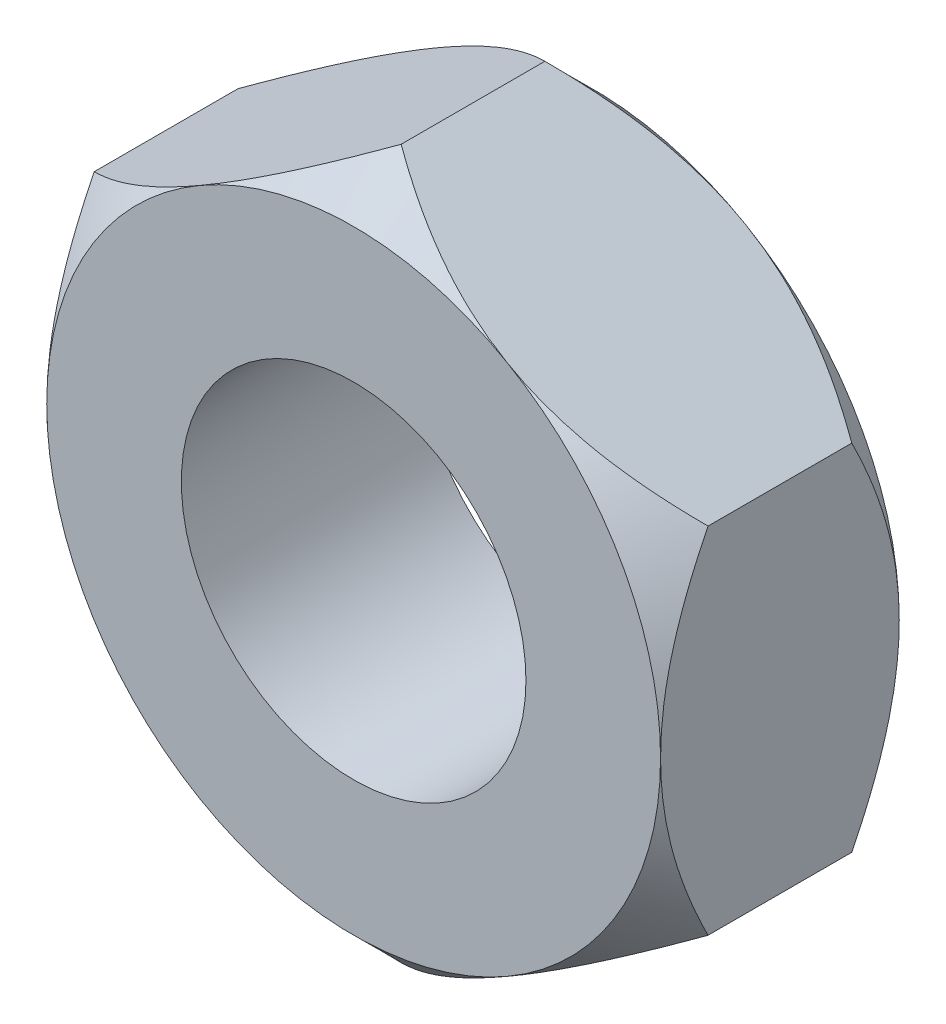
ISO-10303-21;
HEADER;
FILE_DESCRIPTION(('STEP AP214'),'2;1');
FILE_NAME('part.step','',(''),(''),'','','');
FILE_SCHEMA(('AUTOMOTIVE_DESIGN { 1 0 10303 214 1 1 1 1 }'));
ENDSEC;
DATA;
#1=APPLICATION_CONTEXT('core data for automotive mechanical design processes');
#2=APPLICATION_PROTOCOL_DEFINITION('international standard','automotive_design',2000,#1);
#3=PRODUCT_CONTEXT('',#1,'mechanical');
#4=PRODUCT('Part','Part','',(#3));
#5=PRODUCT_RELATED_PRODUCT_CATEGORY('part','',(#4));
#6=PRODUCT_DEFINITION_FORMATION('','',#4);
#7=PRODUCT_DEFINITION_CONTEXT('part definition',#1,'design');
#8=PRODUCT_DEFINITION('design','',#6,#7);
#9=PRODUCT_DEFINITION_SHAPE('','',#8);
#10=(LENGTH_UNIT() NAMED_UNIT(*) SI_UNIT(.MILLI.,.METRE.));
#11=(NAMED_UNIT(*) PLANE_ANGLE_UNIT() SI_UNIT($,.RADIAN.));
#12=(NAMED_UNIT(*) SI_UNIT($,.STERADIAN.) SOLID_ANGLE_UNIT());
#13=UNCERTAINTY_MEASURE_WITH_UNIT(LENGTH_MEASURE(1.E-05),#10,'distance_accuracy_value','');
#14=(GEOMETRIC_REPRESENTATION_CONTEXT(3) GLOBAL_UNCERTAINTY_ASSIGNED_CONTEXT((#13)) GLOBAL_UNIT_ASSIGNED_CONTEXT((#10,
#11,#12)) REPRESENTATION_CONTEXT('',''));
#15=CARTESIAN_POINT('',(0.,0.,0.));
#16=DIRECTION('',(0.,0.,1.));
#17=DIRECTION('',(1.,0.,0.));
#18=AXIS2_PLACEMENT_3D('',#15,#16,#17);
#19=CARTESIAN_POINT('',(-9.,5.1961524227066,3.5));
#20=DIRECTION('',(-0.500000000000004,0.866025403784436,0.));
#21=DIRECTION('',(-0.866025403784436,-0.500000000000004,0.));
#22=AXIS2_PLACEMENT_3D('',#19,#20,#21);
#23=PLANE('',#22);
#24=DIRECTION('',(0.,0.,-1.));
#25=VECTOR('',#24,1.);
#26=CARTESIAN_POINT('',(-9.,5.1961524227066,3.5));
#27=LINE('',#26,#25);
#28=CARTESIAN_POINT('',(-9.,5.1961524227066,2.10769515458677));
#29=VERTEX_POINT('',#28);
#30=CARTESIAN_POINT('',(-9.,5.1961524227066,-2.10769515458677));
#31=VERTEX_POINT('',#30);
#32=EDGE_CURVE('E137',#29,#31,#27,.T.);
#33=ORIENTED_EDGE('',*,*,#32,.F.);
#34=CARTESIAN_POINT('',(-9.0002,5.19603695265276,2.10757968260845));
#35=CARTESIAN_POINT('',(-8.84546874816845,5.28537108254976,2.19690136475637));
#36=CARTESIAN_POINT('',(-8.68952569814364,5.37540484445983,2.28349745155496));
#37=CARTESIAN_POINT('',(-8.37502737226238,5.55698053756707,2.45037263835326));
#38=CARTESIAN_POINT('',(-8.21647072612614,5.64852325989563,2.53064828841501));
#39=CARTESIAN_POINT('',(-7.89580870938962,5.83365756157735,2.6843567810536));
#40=CARTESIAN_POINT('',(-7.73368821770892,5.92725787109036,2.75774781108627));
#41=CARTESIAN_POINT('',(-7.40678444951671,6.11599584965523,2.89609306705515));
#42=CARTESIAN_POINT('',(-7.2420015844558,6.21113328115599,2.96104858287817));
#43=CARTESIAN_POINT('',(-6.91242253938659,6.40141583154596,3.08046759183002));
#44=CARTESIAN_POINT('',(-6.74766686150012,6.49653756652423,3.13507926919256));
#45=CARTESIAN_POINT('',(-6.41584590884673,6.68811448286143,3.23394871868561));
#46=CARTESIAN_POINT('',(-6.24878088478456,6.78456951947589,3.27820760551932));
#47=CARTESIAN_POINT('',(-5.91305583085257,6.97840046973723,3.35525720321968));
#48=CARTESIAN_POINT('',(-5.74440028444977,7.07577379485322,3.38807372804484));
#49=CARTESIAN_POINT('',(-5.40567326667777,7.27133792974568,3.44151749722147));
#50=CARTESIAN_POINT('',(-5.23560201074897,7.36952861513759,3.46214656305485));
#51=CARTESIAN_POINT('',(-4.82115385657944,7.60881036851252,3.49673561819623));
#52=CARTESIAN_POINT('',(-4.57632899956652,7.75016006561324,3.50399417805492));
#53=CARTESIAN_POINT('',(-4.08712205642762,8.03260382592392,3.49181130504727));
#54=CARTESIAN_POINT('',(-3.84274015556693,8.17369778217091,3.47236051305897));
#55=CARTESIAN_POINT('',(-3.35628001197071,8.45455567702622,3.40790703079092));
#56=CARTESIAN_POINT('',(-3.11420465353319,8.59431795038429,3.36287576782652));
#57=CARTESIAN_POINT('',(-2.63421474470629,8.87144025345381,3.24970910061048));
#58=CARTESIAN_POINT('',(-2.39629987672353,9.00880046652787,3.18157546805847));
#59=CARTESIAN_POINT('',(-1.9739675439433,9.25263415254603,3.0414069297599));
#60=CARTESIAN_POINT('',(-1.78861473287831,9.35964764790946,2.9730590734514));
#61=CARTESIAN_POINT('',(-1.42123625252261,9.5717537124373,2.82534982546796));
#62=CARTESIAN_POINT('',(-1.23921068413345,9.67684622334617,2.74598810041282));
#63=CARTESIAN_POINT('',(-0.87906001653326,9.88477930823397,2.57802998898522));
#64=CARTESIAN_POINT('',(-0.700924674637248,9.98762579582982,2.48946264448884));
#65=CARTESIAN_POINT('',(-0.347952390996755,10.1914144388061,2.30425596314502));
#66=CARTESIAN_POINT('',(-0.173113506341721,10.2923577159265,2.20762157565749));
#67=CARTESIAN_POINT('',(0.000200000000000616,10.3924203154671,2.10757968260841));
#68=B_SPLINE_CURVE_WITH_KNOTS('',3,(#34,#35,#36,#37,#38,#39,#40,#41,#42,#43,#44,#45,#46,#47,#48,
#49,#50,#51,#52,#53,#54,#55,#56,#57,#58,#59,#60,#61,#62,#63,#64,#65,#66,#67),.UNSPECIFIED.,.F.,
.F.,(4,2,2,2,2,2,2,2,2,2,2,2,2,2,2,2,4),(0.,0.599280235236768,1.19888534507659,1.80192368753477,
2.40486970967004,2.99838724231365,3.59184084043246,4.18394681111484,4.77596426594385,
5.62301971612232,6.47037205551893,7.31867273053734,8.16690836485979,8.84061799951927,
9.51434803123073,10.1860136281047,10.8572701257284),.UNSPECIFIED.);
#69=CARTESIAN_POINT('',(-4.50000000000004,7.79422863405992,3.5));
#70=VERTEX_POINT('',#69);
#71=EDGE_CURVE('E120',#29,#70,#68,.T.);
#72=ORIENTED_EDGE('',*,*,#71,.T.);
#73=CARTESIAN_POINT('',(0.,10.3923048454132,2.10769515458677));
#74=VERTEX_POINT('',#73);
#75=EDGE_CURVE('E131',#70,#74,#68,.T.);
#76=ORIENTED_EDGE('',*,*,#75,.T.);
#77=DIRECTION('',(0.,0.,-1.));
#78=VECTOR('',#77,1.);
#79=CARTESIAN_POINT('',(0.,10.3923048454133,3.5));
#80=LINE('',#79,#78);
#81=CARTESIAN_POINT('',(0.,10.3923048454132,-2.10769515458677));
#82=VERTEX_POINT('',#81);
#83=EDGE_CURVE('E169',#74,#82,#80,.T.);
#84=ORIENTED_EDGE('',*,*,#83,.T.);
#85=CARTESIAN_POINT('',(0.0002,10.3924203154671,-2.10757968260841));
#86=CARTESIAN_POINT('',(-0.154531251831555,10.3030861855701,-2.19690136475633));
#87=CARTESIAN_POINT('',(-0.310474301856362,10.2130524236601,-2.28349745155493));
#88=CARTESIAN_POINT('',(-0.624972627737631,10.0314767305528,-2.45037263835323));
#89=CARTESIAN_POINT('',(-0.783529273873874,9.93993400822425,-2.53064828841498));
#90=CARTESIAN_POINT('',(-1.1041912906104,9.75479970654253,-2.68435678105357));
#91=CARTESIAN_POINT('',(-1.2663117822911,9.66119939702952,-2.75774781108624));
#92=CARTESIAN_POINT('',(-1.59321555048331,9.47246141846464,-2.89609306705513));
#93=CARTESIAN_POINT('',(-1.75799841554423,9.37732398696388,-2.96104858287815));
#94=CARTESIAN_POINT('',(-2.08757746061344,9.18704143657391,-3.08046759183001));
#95=CARTESIAN_POINT('',(-2.25233313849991,9.09191970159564,-3.13507926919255));
#96=CARTESIAN_POINT('',(-2.58415409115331,8.90034278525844,-3.2339487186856));
#97=CARTESIAN_POINT('',(-2.75121911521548,8.80388774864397,-3.27820760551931));
#98=CARTESIAN_POINT('',(-3.08694416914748,8.61005679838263,-3.35525720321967));
#99=CARTESIAN_POINT('',(-3.25559971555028,8.51268347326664,-3.38807372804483));
#100=CARTESIAN_POINT('',(-3.59432673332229,8.31711933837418,-3.44151749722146));
#101=CARTESIAN_POINT('',(-3.76439798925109,8.21892865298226,-3.46214656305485));
#102=CARTESIAN_POINT('',(-4.17884614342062,7.97964689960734,-3.49673561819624));
#103=CARTESIAN_POINT('',(-4.42367100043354,7.83829720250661,-3.50399417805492));
#104=CARTESIAN_POINT('',(-4.91287794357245,7.55585344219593,-3.49181130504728));
#105=CARTESIAN_POINT('',(-5.15725984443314,7.41475948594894,-3.47236051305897));
#106=CARTESIAN_POINT('',(-5.64371998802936,7.13390159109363,-3.40790703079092));
#107=CARTESIAN_POINT('',(-5.88579534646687,6.99413931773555,-3.36287576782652));
#108=CARTESIAN_POINT('',(-6.36578525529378,6.71701701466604,-3.24970910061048));
#109=CARTESIAN_POINT('',(-6.60370012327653,6.57965680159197,-3.18157546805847));
#110=CARTESIAN_POINT('',(-7.02603245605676,6.33582311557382,-3.0414069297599));
#111=CARTESIAN_POINT('',(-7.21138526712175,6.2288096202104,-2.97305907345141));
#112=CARTESIAN_POINT('',(-7.57876374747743,6.01670355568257,-2.82534982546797));
#113=CARTESIAN_POINT('',(-7.76078931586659,5.91161104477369,-2.74598810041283));
#114=CARTESIAN_POINT('',(-8.12093998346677,5.7036779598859,-2.57802998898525));
#115=CARTESIAN_POINT('',(-8.29907532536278,5.60083147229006,-2.48946264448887));
#116=CARTESIAN_POINT('',(-8.65204760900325,5.39704282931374,-2.30425596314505));
#117=CARTESIAN_POINT('',(-8.82688649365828,5.29609955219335,-2.20762157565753));
#118=CARTESIAN_POINT('',(-9.0002,5.19603695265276,-2.10757968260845));
#119=B_SPLINE_CURVE_WITH_KNOTS('',3,(#85,#86,#87,#88,#89,#90,#91,#92,#93,#94,#95,#96,#97,#98,
#99,#100,#101,#102,#103,#104,#105,#106,#107,#108,#109,#110,#111,#112,#113,#114,#115,#116,#117,
#118),.UNSPECIFIED.,.F.,.F.,(4,2,2,2,2,2,2,2,2,2,2,2,2,2,2,2,4),(0.,0.599280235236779,
1.19888534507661,1.8019236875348,2.40486970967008,2.9983872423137,3.59184084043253,
4.18394681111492,4.77596426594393,5.6230197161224,6.47037205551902,7.31867273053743,
8.16690836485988,8.84061799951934,9.51434803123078,10.1860136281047,10.8572701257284),.UNSPECIFIED.);
#120=CARTESIAN_POINT('',(-4.50000000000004,7.79422863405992,-3.5));
#121=VERTEX_POINT('',#120);
#122=EDGE_CURVE('E175',#82,#121,#119,.T.);
#123=ORIENTED_EDGE('',*,*,#122,.T.);
#124=EDGE_CURVE('E146',#121,#31,#119,.T.);
#125=ORIENTED_EDGE('',*,*,#124,.T.);
#126=EDGE_LOOP('',(#33,#72,#76,#84,#123,#125));
#127=FACE_BOUND('',#126,.T.);
#128=ADVANCED_FACE('F32',(#127),#23,.T.);
#129=CARTESIAN_POINT('',(-9.,5.1961524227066,3.5));
#130=DIRECTION('',(1.,0.,0.));
#131=DIRECTION('',(0.,1.,0.));
#132=AXIS2_PLACEMENT_3D('',#129,#130,#131);
#133=PLANE('',#132);
#134=CARTESIAN_POINT('',(-9.,-10.8439419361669,-1.59223462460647));
#135=CARTESIAN_POINT('',(-9.,-10.5819573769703,-1.39068338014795));
#136=CARTESIAN_POINT('',(-9.,-10.3185611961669,-1.19093818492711));
#137=CARTESIAN_POINT('',(-9.,-9.7883686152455,-0.79588501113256));
#138=CARTESIAN_POINT('',(-9.,-9.52157142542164,-0.600578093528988));
#139=CARTESIAN_POINT('',(-9.,-8.98205017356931,-0.21383670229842));
#140=CARTESIAN_POINT('',(-9.,-8.70929626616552,-0.0224437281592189));
#141=CARTESIAN_POINT('',(-9.,-8.15924902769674,0.353681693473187));
#142=CARTESIAN_POINT('',(-9.,-7.88195601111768,0.538414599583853));
#143=CARTESIAN_POINT('',(-9.,-7.30431575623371,0.91115732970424));
#144=CARTESIAN_POINT('',(-9.,-7.00362157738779,1.09863219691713));
#145=CARTESIAN_POINT('',(-9.,-6.39517188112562,1.46194565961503));
#146=CARTESIAN_POINT('',(-9.,-6.08741518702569,1.63778229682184));
#147=CARTESIAN_POINT('',(-9.,-5.46475627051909,1.97407461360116));
#148=CARTESIAN_POINT('',(-9.,-5.14987862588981,2.13457544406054));
#149=CARTESIAN_POINT('',(-9.,-4.5112220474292,2.4366001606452));
#150=CARTESIAN_POINT('',(-9.,-4.18744740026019,2.57813299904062));
#151=CARTESIAN_POINT('',(-9.,-3.56271510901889,2.82431315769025));
#152=CARTESIAN_POINT('',(-9.,-3.2626577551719,2.93122192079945));
#153=CARTESIAN_POINT('',(-9.,-2.65489848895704,3.12102169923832));
#154=CARTESIAN_POINT('',(-9.,-2.34719609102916,3.20391118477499));
#155=CARTESIAN_POINT('',(-9.,-1.73134355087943,3.33980403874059));
#156=CARTESIAN_POINT('',(-9.,-1.42331523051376,3.39335021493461));
#157=CARTESIAN_POINT('',(-9.,-0.803431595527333,3.46943937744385));
#158=CARTESIAN_POINT('',(-9.,-0.49157708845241,3.49198879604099));
#159=CARTESIAN_POINT('',(-9.,0.119139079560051,3.50416364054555));
#160=CARTESIAN_POINT('',(-9.,0.417973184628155,3.49518434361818));
#161=CARTESIAN_POINT('',(-9.,1.01330943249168,3.44800060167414));
#162=CARTESIAN_POINT('',(-9.,1.30981136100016,3.40979350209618));
#163=CARTESIAN_POINT('',(-9.,1.90336237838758,3.30566508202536));
#164=CARTESIAN_POINT('',(-9.,2.2003241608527,3.23925446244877));
#165=CARTESIAN_POINT('',(-9.,2.78770810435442,3.08240337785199));
#166=CARTESIAN_POINT('',(-9.,3.0781306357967,2.99196427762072));
#167=CARTESIAN_POINT('',(-9.,3.66843569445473,2.78523910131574));
#168=CARTESIAN_POINT('',(-9.,3.96789645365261,2.66776229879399));
#169=CARTESIAN_POINT('',(-9.,4.55911528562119,2.41465930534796));
#170=CARTESIAN_POINT('',(-9.,4.85086981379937,2.27902493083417));
#171=CARTESIAN_POINT('',(-9.,5.42805401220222,1.99282333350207));
#172=CARTESIAN_POINT('',(-9.,5.71346068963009,1.84221011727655));
#173=CARTESIAN_POINT('',(-9.,6.27773408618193,1.52936524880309));
#174=CARTESIAN_POINT('',(-9.,6.55660180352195,1.36713538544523));
#175=CARTESIAN_POINT('',(-9.,7.09502256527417,1.04156699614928));
#176=CARTESIAN_POINT('',(-9.,7.35484936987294,0.878678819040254));
#177=CARTESIAN_POINT('',(-9.,7.87003895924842,0.545969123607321));
#178=CARTESIAN_POINT('',(-9.,8.12540140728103,0.376147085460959));
#179=CARTESIAN_POINT('',(-9.,8.63019326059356,0.0321886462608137));
#180=CARTESIAN_POINT('',(-9.,8.87965384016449,-0.14190216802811));
#181=CARTESIAN_POINT('',(-9.,9.37515273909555,-0.494750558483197));
#182=CARTESIAN_POINT('',(-9.,9.6211919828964,-0.673506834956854));
#183=CARTESIAN_POINT('',(-9.,9.86579603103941,-0.854172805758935));
#184=B_SPLINE_CURVE_WITH_KNOTS('',3,(#134,#135,#136,#137,#138,#139,#140,#141,#142,#143,#144,
#145,#146,#147,#148,#149,#150,#151,#152,#153,#154,#155,#156,#157,#158,#159,#160,#161,#162,#163,
#164,#165,#166,#167,#168,#169,#170,#171,#172,#173,#174,#175,#176,#177,#178,#179,#180,#181,#182,
#183),.UNSPECIFIED.,.F.,.F.,(4,2,2,2,2,2,2,2,2,2,2,2,2,2,2,2,2,2,2,2,2,2,2,2,4),(0.,
0.991647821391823,1.983530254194,2.98306486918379,3.98253052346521,5.04537065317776,
6.10838916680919,7.16817478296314,8.22745844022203,9.18223679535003,10.1370759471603,
11.0735982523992,12.0099261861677,12.9053498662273,13.8008548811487,14.7125749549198,
15.6242432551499,16.5885416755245,17.5532761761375,18.5210702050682,19.488715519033,
20.4085771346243,21.3285078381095,22.241052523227,23.1533456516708),.UNSPECIFIED.);
#185=CARTESIAN_POINT('',(-9.,0.,3.5));
#186=VERTEX_POINT('',#185);
#187=EDGE_CURVE('E123',#29,#186,#184,.F.);
#188=ORIENTED_EDGE('',*,*,#187,.F.);
#189=ORIENTED_EDGE('',*,*,#32,.T.);
#190=CARTESIAN_POINT('',(-9.,-10.8439419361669,1.59223462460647));
#191=CARTESIAN_POINT('',(-9.,-10.5819573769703,1.39068338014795));
#192=CARTESIAN_POINT('',(-9.,-10.3185611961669,1.19093818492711));
#193=CARTESIAN_POINT('',(-9.,-9.7883686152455,0.79588501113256));
#194=CARTESIAN_POINT('',(-9.,-9.52157142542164,0.600578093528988));
#195=CARTESIAN_POINT('',(-9.,-8.98205017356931,0.21383670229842));
#196=CARTESIAN_POINT('',(-9.,-8.70929626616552,0.0224437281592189));
#197=CARTESIAN_POINT('',(-9.,-8.15924902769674,-0.353681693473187));
#198=CARTESIAN_POINT('',(-9.,-7.88195601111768,-0.538414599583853));
#199=CARTESIAN_POINT('',(-9.,-7.30431575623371,-0.91115732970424));
#200=CARTESIAN_POINT('',(-9.,-7.00362157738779,-1.09863219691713));
#201=CARTESIAN_POINT('',(-9.,-6.39517188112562,-1.46194565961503));
#202=CARTESIAN_POINT('',(-9.,-6.08741518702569,-1.63778229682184));
#203=CARTESIAN_POINT('',(-9.,-5.46475627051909,-1.97407461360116));
#204=CARTESIAN_POINT('',(-9.,-5.14987862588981,-2.13457544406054));
#205=CARTESIAN_POINT('',(-9.,-4.5112220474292,-2.4366001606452));
#206=CARTESIAN_POINT('',(-9.,-4.18744740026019,-2.57813299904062));
#207=CARTESIAN_POINT('',(-9.,-3.56271510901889,-2.82431315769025));
#208=CARTESIAN_POINT('',(-9.,-3.2626577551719,-2.93122192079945));
#209=CARTESIAN_POINT('',(-9.,-2.65489848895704,-3.12102169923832));
#210=CARTESIAN_POINT('',(-9.,-2.34719609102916,-3.20391118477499));
#211=CARTESIAN_POINT('',(-9.,-1.73134355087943,-3.33980403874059));
#212=CARTESIAN_POINT('',(-9.,-1.42331523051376,-3.39335021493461));
#213=CARTESIAN_POINT('',(-9.,-0.803431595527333,-3.46943937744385));
#214=CARTESIAN_POINT('',(-9.,-0.49157708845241,-3.49198879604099));
#215=CARTESIAN_POINT('',(-9.,0.119139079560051,-3.50416364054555));
#216=CARTESIAN_POINT('',(-9.,0.417973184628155,-3.49518434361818));
#217=CARTESIAN_POINT('',(-9.,1.01330943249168,-3.44800060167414));
#218=CARTESIAN_POINT('',(-9.,1.30981136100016,-3.40979350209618));
#219=CARTESIAN_POINT('',(-9.,1.90336237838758,-3.30566508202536));
#220=CARTESIAN_POINT('',(-9.,2.2003241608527,-3.23925446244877));
#221=CARTESIAN_POINT('',(-9.,2.78770810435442,-3.08240337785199));
#222=CARTESIAN_POINT('',(-9.,3.0781306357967,-2.99196427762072));
#223=CARTESIAN_POINT('',(-9.,3.66843569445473,-2.78523910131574));
#224=CARTESIAN_POINT('',(-9.,3.96789645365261,-2.66776229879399));
#225=CARTESIAN_POINT('',(-9.,4.55911528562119,-2.41465930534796));
#226=CARTESIAN_POINT('',(-9.,4.85086981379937,-2.27902493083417));
#227=CARTESIAN_POINT('',(-9.,5.42805401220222,-1.99282333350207));
#228=CARTESIAN_POINT('',(-9.,5.71346068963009,-1.84221011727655));
#229=CARTESIAN_POINT('',(-9.,6.27773408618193,-1.52936524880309));
#230=CARTESIAN_POINT('',(-9.,6.55660180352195,-1.36713538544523));
#231=CARTESIAN_POINT('',(-9.,7.09502256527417,-1.04156699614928));
#232=CARTESIAN_POINT('',(-9.,7.35484936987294,-0.878678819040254));
#233=CARTESIAN_POINT('',(-9.,7.87003895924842,-0.545969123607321));
#234=CARTESIAN_POINT('',(-9.,8.12540140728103,-0.376147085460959));
#235=CARTESIAN_POINT('',(-9.,8.63019326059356,-0.0321886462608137));
#236=CARTESIAN_POINT('',(-9.,8.87965384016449,0.14190216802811));
#237=CARTESIAN_POINT('',(-9.,9.37515273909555,0.494750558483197));
#238=CARTESIAN_POINT('',(-9.,9.6211919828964,0.673506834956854));
#239=CARTESIAN_POINT('',(-9.,9.86579603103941,0.854172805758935));
#240=B_SPLINE_CURVE_WITH_KNOTS('',3,(#190,#191,#192,#193,#194,#195,#196,#197,#198,#199,#200,
#201,#202,#203,#204,#205,#206,#207,#208,#209,#210,#211,#212,#213,#214,#215,#216,#217,#218,#219,
#220,#221,#222,#223,#224,#225,#226,#227,#228,#229,#230,#231,#232,#233,#234,#235,#236,#237,#238,
#239),.UNSPECIFIED.,.F.,.F.,(4,2,2,2,2,2,2,2,2,2,2,2,2,2,2,2,2,2,2,2,2,2,2,2,4),(0.,
0.991647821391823,1.983530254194,2.98306486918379,3.98253052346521,5.04537065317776,
6.10838916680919,7.16817478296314,8.22745844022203,9.18223679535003,10.1370759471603,
11.0735982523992,12.0099261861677,12.9053498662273,13.8008548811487,14.7125749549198,
15.6242432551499,16.5885416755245,17.5532761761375,18.5210702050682,19.488715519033,
20.4085771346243,21.3285078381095,22.241052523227,23.1533456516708),.UNSPECIFIED.);
#241=CARTESIAN_POINT('',(-9.,0.,-3.5));
#242=VERTEX_POINT('',#241);
#243=EDGE_CURVE('E170',#242,#31,#240,.T.);
#244=ORIENTED_EDGE('',*,*,#243,.F.);
#245=CARTESIAN_POINT('',(-9.,-5.1961524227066,-2.10769515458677));
#246=VERTEX_POINT('',#245);
#247=EDGE_CURVE('E156',#246,#242,#240,.T.);
#248=ORIENTED_EDGE('',*,*,#247,.F.);
#249=DIRECTION('',(0.,0.,-1.));
#250=VECTOR('',#249,1.);
#251=CARTESIAN_POINT('',(-9.,-5.1961524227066,3.5));
#252=LINE('',#251,#250);
#253=CARTESIAN_POINT('',(-9.,-5.1961524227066,2.10769515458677));
#254=VERTEX_POINT('',#253);
#255=EDGE_CURVE('E148',#254,#246,#252,.T.);
#256=ORIENTED_EDGE('',*,*,#255,.F.);
#257=EDGE_CURVE('E140',#186,#254,#184,.F.);
#258=ORIENTED_EDGE('',*,*,#257,.F.);
#259=EDGE_LOOP('',(#188,#189,#244,#248,#256,#258));
#260=FACE_BOUND('',#259,.T.);
#261=ADVANCED_FACE('F135',(#260),#133,.F.);
#262=CARTESIAN_POINT('',(-9.,-5.1961524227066,3.5));
#263=DIRECTION('',(0.500000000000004,0.866025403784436,0.));
#264=DIRECTION('',(-0.866025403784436,0.500000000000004,0.));
#265=AXIS2_PLACEMENT_3D('',#262,#263,#264);
#266=PLANE('',#265);
#267=CARTESIAN_POINT('',(-9.0002,-5.19603695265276,2.10757968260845));
#268=CARTESIAN_POINT('',(-8.84546874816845,-5.28537108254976,2.19690136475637));
#269=CARTESIAN_POINT('',(-8.68952569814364,-5.37540484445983,2.28349745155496));
#270=CARTESIAN_POINT('',(-8.37502737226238,-5.55698053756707,2.45037263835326));
#271=CARTESIAN_POINT('',(-8.21647072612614,-5.64852325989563,2.53064828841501));
#272=CARTESIAN_POINT('',(-7.89580870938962,-5.83365756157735,2.6843567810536));
#273=CARTESIAN_POINT('',(-7.73368821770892,-5.92725787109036,2.75774781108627));
#274=CARTESIAN_POINT('',(-7.40678444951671,-6.11599584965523,2.89609306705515));
#275=CARTESIAN_POINT('',(-7.2420015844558,-6.21113328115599,2.96104858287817));
#276=CARTESIAN_POINT('',(-6.91242253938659,-6.40141583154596,3.08046759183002));
#277=CARTESIAN_POINT('',(-6.74766686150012,-6.49653756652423,3.13507926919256));
#278=CARTESIAN_POINT('',(-6.41584590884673,-6.68811448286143,3.23394871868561));
#279=CARTESIAN_POINT('',(-6.24878088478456,-6.78456951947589,3.27820760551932));
#280=CARTESIAN_POINT('',(-5.91305583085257,-6.97840046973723,3.35525720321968));
#281=CARTESIAN_POINT('',(-5.74440028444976,-7.07577379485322,3.38807372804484));
#282=CARTESIAN_POINT('',(-5.40567326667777,-7.27133792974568,3.44151749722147));
#283=CARTESIAN_POINT('',(-5.23560201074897,-7.36952861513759,3.46214656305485));
#284=CARTESIAN_POINT('',(-4.82115385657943,-7.60881036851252,3.49673561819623));
#285=CARTESIAN_POINT('',(-4.57632899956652,-7.75016006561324,3.50399417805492));
#286=CARTESIAN_POINT('',(-4.08712205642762,-8.03260382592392,3.49181130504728));
#287=CARTESIAN_POINT('',(-3.84274015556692,-8.17369778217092,3.47236051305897));
#288=CARTESIAN_POINT('',(-3.3562800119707,-8.45455567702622,3.40790703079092));
#289=CARTESIAN_POINT('',(-3.11420465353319,-8.5943179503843,3.36287576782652));
#290=CARTESIAN_POINT('',(-2.63421474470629,-8.87144025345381,3.24970910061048));
#291=CARTESIAN_POINT('',(-2.39629987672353,-9.00880046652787,3.18157546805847));
#292=CARTESIAN_POINT('',(-1.97396754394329,-9.25263415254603,3.04140692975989));
#293=CARTESIAN_POINT('',(-1.78861473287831,-9.35964764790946,2.9730590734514));
#294=CARTESIAN_POINT('',(-1.42123625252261,-9.5717537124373,2.82534982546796));
#295=CARTESIAN_POINT('',(-1.23921068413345,-9.67684622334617,2.74598810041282));
#296=CARTESIAN_POINT('',(-0.879060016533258,-9.88477930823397,2.57802998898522));
#297=CARTESIAN_POINT('',(-0.700924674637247,-9.98762579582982,2.48946264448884));
#298=CARTESIAN_POINT('',(-0.347952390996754,-10.1914144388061,2.30425596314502));
#299=CARTESIAN_POINT('',(-0.173113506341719,-10.2923577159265,2.20762157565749));
#300=CARTESIAN_POINT('',(0.000200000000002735,-10.3924203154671,2.10757968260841));
#301=B_SPLINE_CURVE_WITH_KNOTS('',3,(#267,#268,#269,#270,#271,#272,#273,#274,#275,#276,#277,
#278,#279,#280,#281,#282,#283,#284,#285,#286,#287,#288,#289,#290,#291,#292,#293,#294,#295,#296,
#297,#298,#299,#300),.UNSPECIFIED.,.F.,.F.,(4,2,2,2,2,2,2,2,2,2,2,2,2,2,2,2,4),(0.,
0.599280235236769,1.19888534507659,1.80192368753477,2.40486970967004,2.99838724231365,
3.59184084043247,4.18394681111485,4.77596426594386,5.62301971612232,6.47037205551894,
7.31867273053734,8.1669083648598,8.84061799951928,9.51434803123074,10.1860136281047,
10.8572701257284),.UNSPECIFIED.);
#302=CARTESIAN_POINT('',(-4.50000000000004,-7.79422863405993,3.5));
#303=VERTEX_POINT('',#302);
#304=EDGE_CURVE('E446',#254,#303,#301,.T.);
#305=ORIENTED_EDGE('',*,*,#304,.F.);
#306=ORIENTED_EDGE('',*,*,#255,.T.);
#307=CARTESIAN_POINT('',(0.000200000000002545,-10.3924203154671,-2.10757968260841));
#308=CARTESIAN_POINT('',(-0.154531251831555,-10.3030861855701,-2.19690136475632));
#309=CARTESIAN_POINT('',(-0.310474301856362,-10.2130524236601,-2.28349745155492));
#310=CARTESIAN_POINT('',(-0.624972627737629,-10.0314767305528,-2.45037263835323));
#311=CARTESIAN_POINT('',(-0.78352927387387,-9.93993400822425,-2.53064828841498));
#312=CARTESIAN_POINT('',(-1.10419129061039,-9.75479970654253,-2.68435678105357));
#313=CARTESIAN_POINT('',(-1.2663117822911,-9.66119939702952,-2.75774781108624));
#314=CARTESIAN_POINT('',(-1.59321555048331,-9.47246141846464,-2.89609306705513));
#315=CARTESIAN_POINT('',(-1.75799841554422,-9.37732398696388,-2.96104858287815));
#316=CARTESIAN_POINT('',(-2.08757746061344,-9.18704143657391,-3.08046759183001));
#317=CARTESIAN_POINT('',(-2.25233313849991,-9.09191970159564,-3.13507926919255));
#318=CARTESIAN_POINT('',(-2.5841540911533,-8.90034278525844,-3.2339487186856));
#319=CARTESIAN_POINT('',(-2.75121911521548,-8.80388774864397,-3.27820760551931));
#320=CARTESIAN_POINT('',(-3.08694416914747,-8.61005679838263,-3.35525720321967));
#321=CARTESIAN_POINT('',(-3.25559971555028,-8.51268347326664,-3.38807372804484));
#322=CARTESIAN_POINT('',(-3.59432673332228,-8.31711933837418,-3.44151749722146));
#323=CARTESIAN_POINT('',(-3.76439798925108,-8.21892865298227,-3.46214656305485));
#324=CARTESIAN_POINT('',(-4.17884614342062,-7.97964689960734,-3.49673561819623));
#325=CARTESIAN_POINT('',(-4.42367100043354,-7.83829720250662,-3.50399417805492));
#326=CARTESIAN_POINT('',(-4.91287794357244,-7.55585344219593,-3.49181130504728));
#327=CARTESIAN_POINT('',(-5.15725984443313,-7.41475948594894,-3.47236051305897));
#328=CARTESIAN_POINT('',(-5.64371998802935,-7.13390159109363,-3.40790703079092));
#329=CARTESIAN_POINT('',(-5.88579534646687,-6.99413931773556,-3.36287576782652));
#330=CARTESIAN_POINT('',(-6.36578525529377,-6.71701701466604,-3.24970910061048));
#331=CARTESIAN_POINT('',(-6.60370012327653,-6.57965680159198,-3.18157546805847));
#332=CARTESIAN_POINT('',(-7.02603245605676,-6.33582311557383,-3.0414069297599));
#333=CARTESIAN_POINT('',(-7.21138526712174,-6.2288096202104,-2.97305907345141));
#334=CARTESIAN_POINT('',(-7.57876374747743,-6.01670355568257,-2.82534982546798));
#335=CARTESIAN_POINT('',(-7.76078931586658,-5.91161104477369,-2.74598810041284));
#336=CARTESIAN_POINT('',(-8.12093998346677,-5.7036779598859,-2.57802998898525));
#337=CARTESIAN_POINT('',(-8.29907532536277,-5.60083147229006,-2.48946264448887));
#338=CARTESIAN_POINT('',(-8.65204760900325,-5.39704282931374,-2.30425596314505));
#339=CARTESIAN_POINT('',(-8.82688649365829,-5.29609955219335,-2.20762157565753));
#340=CARTESIAN_POINT('',(-9.0002,-5.19603695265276,-2.10757968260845));
#341=B_SPLINE_CURVE_WITH_KNOTS('',3,(#307,#308,#309,#310,#311,#312,#313,#314,#315,#316,#317,
#318,#319,#320,#321,#322,#323,#324,#325,#326,#327,#328,#329,#330,#331,#332,#333,#334,#335,#336,
#337,#338,#339,#340),.UNSPECIFIED.,.F.,.F.,(4,2,2,2,2,2,2,2,2,2,2,2,2,2,2,2,4),(0.,
0.599280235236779,1.19888534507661,1.8019236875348,2.40486970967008,2.9983872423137,
3.59184084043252,4.18394681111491,4.77596426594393,5.6230197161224,6.47037205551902,
7.31867273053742,8.16690836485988,8.84061799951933,9.51434803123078,10.1860136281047,
10.8572701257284),.UNSPECIFIED.);
#342=CARTESIAN_POINT('',(-4.50000000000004,-7.79422863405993,-3.5));
#343=VERTEX_POINT('',#342);
#344=EDGE_CURVE('E176',#343,#246,#341,.T.);
#345=ORIENTED_EDGE('',*,*,#344,.F.);
#346=CARTESIAN_POINT('',(0.,-10.3923048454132,-2.10769515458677));
#347=VERTEX_POINT('',#346);
#348=EDGE_CURVE('E182',#347,#343,#341,.T.);
#349=ORIENTED_EDGE('',*,*,#348,.F.);
#350=DIRECTION('',(0.,0.,-1.));
#351=VECTOR('',#350,1.);
#352=CARTESIAN_POINT('',(0.,-10.3923048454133,3.5));
#353=LINE('',#352,#351);
#354=CARTESIAN_POINT('',(0.,-10.3923048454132,2.10769515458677));
#355=VERTEX_POINT('',#354);
#356=EDGE_CURVE('E153',#355,#347,#353,.T.);
#357=ORIENTED_EDGE('',*,*,#356,.F.);
#358=EDGE_CURVE('E274',#303,#355,#301,.T.);
#359=ORIENTED_EDGE('',*,*,#358,.F.);
#360=EDGE_LOOP('',(#305,#306,#345,#349,#357,#359));
#361=FACE_BOUND('',#360,.T.);
#362=ADVANCED_FACE('F280',(#361),#266,.F.);
#363=CARTESIAN_POINT('',(9.,-5.1961524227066,3.5));
#364=DIRECTION('',(0.500000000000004,-0.866025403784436,0.));
#365=DIRECTION('',(0.866025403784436,0.500000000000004,0.));
#366=AXIS2_PLACEMENT_3D('',#363,#364,#365);
#367=PLANE('',#366);
#368=DIRECTION('',(0.,0.,-1.));
#369=VECTOR('',#368,1.);
#370=CARTESIAN_POINT('',(9.,-5.1961524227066,3.5));
#371=LINE('',#370,#369);
#372=CARTESIAN_POINT('',(9.,-5.19615242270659,2.10769515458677));
#373=VERTEX_POINT('',#372);
#374=CARTESIAN_POINT('',(9.,-5.19615242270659,-2.10769515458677));
#375=VERTEX_POINT('',#374);
#376=EDGE_CURVE('E165',#373,#375,#371,.T.);
#377=ORIENTED_EDGE('',*,*,#376,.F.);
#378=CARTESIAN_POINT('',(9.0002,-5.19603695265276,2.10757968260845));
#379=CARTESIAN_POINT('',(8.84546874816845,-5.28537108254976,2.19690136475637));
#380=CARTESIAN_POINT('',(8.68952569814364,-5.37540484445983,2.28349745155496));
#381=CARTESIAN_POINT('',(8.37502737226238,-5.55698053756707,2.45037263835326));
#382=CARTESIAN_POINT('',(8.21647072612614,-5.64852325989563,2.53064828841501));
#383=CARTESIAN_POINT('',(7.89580870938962,-5.83365756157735,2.6843567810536));
#384=CARTESIAN_POINT('',(7.73368821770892,-5.92725787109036,2.75774781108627));
#385=CARTESIAN_POINT('',(7.40678444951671,-6.11599584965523,2.89609306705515));
#386=CARTESIAN_POINT('',(7.2420015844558,-6.21113328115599,2.96104858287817));
#387=CARTESIAN_POINT('',(6.91242253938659,-6.40141583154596,3.08046759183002));
#388=CARTESIAN_POINT('',(6.74766686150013,-6.49653756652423,3.13507926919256));
#389=CARTESIAN_POINT('',(6.41584590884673,-6.68811448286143,3.23394871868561));
#390=CARTESIAN_POINT('',(6.24878088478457,-6.78456951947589,3.27820760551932));
#391=CARTESIAN_POINT('',(5.91305583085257,-6.97840046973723,3.35525720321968));
#392=CARTESIAN_POINT('',(5.74440028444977,-7.07577379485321,3.38807372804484));
#393=CARTESIAN_POINT('',(5.40567326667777,-7.27133792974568,3.44151749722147));
#394=CARTESIAN_POINT('',(5.23560201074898,-7.36952861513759,3.46214656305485));
#395=CARTESIAN_POINT('',(4.82115385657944,-7.60881036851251,3.49673561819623));
#396=CARTESIAN_POINT('',(4.57632899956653,-7.75016006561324,3.50399417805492));
#397=CARTESIAN_POINT('',(4.08712205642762,-8.03260382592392,3.49181130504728));
#398=CARTESIAN_POINT('',(3.84274015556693,-8.17369778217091,3.47236051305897));
#399=CARTESIAN_POINT('',(3.35628001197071,-8.45455567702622,3.40790703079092));
#400=CARTESIAN_POINT('',(3.1142046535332,-8.59431795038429,3.36287576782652));
#401=CARTESIAN_POINT('',(2.6342147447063,-8.87144025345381,3.24970910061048));
#402=CARTESIAN_POINT('',(2.39629987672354,-9.00880046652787,3.18157546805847));
#403=CARTESIAN_POINT('',(1.9739675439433,-9.25263415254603,3.04140692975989));
#404=CARTESIAN_POINT('',(1.78861473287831,-9.35964764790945,2.9730590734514));
#405=CARTESIAN_POINT('',(1.42123625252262,-9.57175371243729,2.82534982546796));
#406=CARTESIAN_POINT('',(1.23921068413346,-9.67684622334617,2.74598810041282));
#407=CARTESIAN_POINT('',(0.879060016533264,-9.88477930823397,2.57802998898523));
#408=CARTESIAN_POINT('',(0.700924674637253,-9.98762579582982,2.48946264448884));
#409=CARTESIAN_POINT('',(0.347952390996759,-10.1914144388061,2.30425596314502));
#410=CARTESIAN_POINT('',(0.173113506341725,-10.2923577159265,2.20762157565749));
#411=CARTESIAN_POINT('',(-0.000199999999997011,-10.3924203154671,2.10757968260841));
#412=B_SPLINE_CURVE_WITH_KNOTS('',3,(#378,#379,#380,#381,#382,#383,#384,#385,#386,#387,#388,
#389,#390,#391,#392,#393,#394,#395,#396,#397,#398,#399,#400,#401,#402,#403,#404,#405,#406,#407,
#408,#409,#410,#411),.UNSPECIFIED.,.F.,.F.,(4,2,2,2,2,2,2,2,2,2,2,2,2,2,2,2,4),(0.,
0.599280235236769,1.19888534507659,1.80192368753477,2.40486970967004,2.99838724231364,
3.59184084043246,4.18394681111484,4.77596426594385,5.62301971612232,6.47037205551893,
7.31867273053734,8.16690836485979,8.84061799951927,9.51434803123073,10.1860136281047,
10.8572701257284),.UNSPECIFIED.);
#413=CARTESIAN_POINT('',(4.50000000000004,-7.79422863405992,3.5));
#414=VERTEX_POINT('',#413);
#415=EDGE_CURVE('E142',#373,#414,#412,.T.);
#416=ORIENTED_EDGE('',*,*,#415,.T.);
#417=EDGE_CURVE('E141',#414,#355,#412,.T.);
#418=ORIENTED_EDGE('',*,*,#417,.T.);
#419=ORIENTED_EDGE('',*,*,#356,.T.);
#420=CARTESIAN_POINT('',(-0.000199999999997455,-10.3924203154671,-2.10757968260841));
#421=CARTESIAN_POINT('',(0.154531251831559,-10.3030861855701,-2.19690136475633));
#422=CARTESIAN_POINT('',(0.310474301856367,-10.2130524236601,-2.28349745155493));
#423=CARTESIAN_POINT('',(0.624972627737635,-10.0314767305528,-2.45037263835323));
#424=CARTESIAN_POINT('',(0.783529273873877,-9.93993400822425,-2.53064828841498));
#425=CARTESIAN_POINT('',(1.1041912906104,-9.75479970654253,-2.68435678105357));
#426=CARTESIAN_POINT('',(1.2663117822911,-9.66119939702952,-2.75774781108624));
#427=CARTESIAN_POINT('',(1.59321555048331,-9.47246141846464,-2.89609306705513));
#428=CARTESIAN_POINT('',(1.75799841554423,-9.37732398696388,-2.96104858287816));
#429=CARTESIAN_POINT('',(2.08757746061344,-9.18704143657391,-3.08046759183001));
#430=CARTESIAN_POINT('',(2.25233313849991,-9.09191970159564,-3.13507926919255));
#431=CARTESIAN_POINT('',(2.58415409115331,-8.90034278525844,-3.2339487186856));
#432=CARTESIAN_POINT('',(2.75121911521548,-8.80388774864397,-3.27820760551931));
#433=CARTESIAN_POINT('',(3.08694416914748,-8.61005679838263,-3.35525720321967));
#434=CARTESIAN_POINT('',(3.25559971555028,-8.51268347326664,-3.38807372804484));
#435=CARTESIAN_POINT('',(3.59432673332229,-8.31711933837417,-3.44151749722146));
#436=CARTESIAN_POINT('',(3.76439798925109,-8.21892865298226,-3.46214656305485));
#437=CARTESIAN_POINT('',(4.17884614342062,-7.97964689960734,-3.49673561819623));
#438=CARTESIAN_POINT('',(4.42367100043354,-7.83829720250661,-3.50399417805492));
#439=CARTESIAN_POINT('',(4.91287794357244,-7.55585344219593,-3.49181130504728));
#440=CARTESIAN_POINT('',(5.15725984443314,-7.41475948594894,-3.47236051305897));
#441=CARTESIAN_POINT('',(5.64371998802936,-7.13390159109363,-3.40790703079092));
#442=CARTESIAN_POINT('',(5.88579534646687,-6.99413931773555,-3.36287576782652));
#443=CARTESIAN_POINT('',(6.36578525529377,-6.71701701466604,-3.24970910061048));
#444=CARTESIAN_POINT('',(6.60370012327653,-6.57965680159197,-3.18157546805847));
#445=CARTESIAN_POINT('',(7.02603245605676,-6.33582311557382,-3.0414069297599));
#446=CARTESIAN_POINT('',(7.21138526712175,-6.2288096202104,-2.97305907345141));
#447=CARTESIAN_POINT('',(7.57876374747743,-6.01670355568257,-2.82534982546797));
#448=CARTESIAN_POINT('',(7.76078931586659,-5.91161104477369,-2.74598810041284));
#449=CARTESIAN_POINT('',(8.12093998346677,-5.7036779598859,-2.57802998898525));
#450=CARTESIAN_POINT('',(8.29907532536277,-5.60083147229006,-2.48946264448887));
#451=CARTESIAN_POINT('',(8.65204760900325,-5.39704282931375,-2.30425596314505));
#452=CARTESIAN_POINT('',(8.82688649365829,-5.29609955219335,-2.20762157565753));
#453=CARTESIAN_POINT('',(9.0002,-5.19603695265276,-2.10757968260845));
#454=B_SPLINE_CURVE_WITH_KNOTS('',3,(#420,#421,#422,#423,#424,#425,#426,#427,#428,#429,#430,
#431,#432,#433,#434,#435,#436,#437,#438,#439,#440,#441,#442,#443,#444,#445,#446,#447,#448,#449,
#450,#451,#452,#453),.UNSPECIFIED.,.F.,.F.,(4,2,2,2,2,2,2,2,2,2,2,2,2,2,2,2,4),(0.,
0.59928023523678,1.19888534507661,1.8019236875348,2.40486970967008,2.9983872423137,
3.59184084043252,4.18394681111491,4.77596426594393,5.6230197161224,6.47037205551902,
7.31867273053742,8.16690836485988,8.84061799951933,9.51434803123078,10.1860136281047,
10.8572701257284),.UNSPECIFIED.);
#455=CARTESIAN_POINT('',(4.50000000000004,-7.79422863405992,-3.5));
#456=VERTEX_POINT('',#455);
#457=EDGE_CURVE('E189',#347,#456,#454,.T.);
#458=ORIENTED_EDGE('',*,*,#457,.T.);
#459=EDGE_CURVE('E194',#456,#375,#454,.T.);
#460=ORIENTED_EDGE('',*,*,#459,.T.);
#461=EDGE_LOOP('',(#377,#416,#418,#419,#458,#460));
#462=FACE_BOUND('',#461,.T.);
#463=ADVANCED_FACE('F209',(#462),#367,.T.);
#464=CARTESIAN_POINT('',(9.,5.1961524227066,3.5));
#465=DIRECTION('',(1.,0.,0.));
#466=DIRECTION('',(0.,1.,0.));
#467=AXIS2_PLACEMENT_3D('',#464,#465,#466);
#468=PLANE('',#467);
#469=DIRECTION('',(0.,0.,-1.));
#470=VECTOR('',#469,1.);
#471=CARTESIAN_POINT('',(9.,5.1961524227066,3.5));
#472=LINE('',#471,#470);
#473=CARTESIAN_POINT('',(9.,5.1961524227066,2.10769515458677));
#474=VERTEX_POINT('',#473);
#475=CARTESIAN_POINT('',(9.,5.1961524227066,-2.10769515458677));
#476=VERTEX_POINT('',#475);
#477=EDGE_CURVE('E167',#474,#476,#472,.T.);
#478=ORIENTED_EDGE('',*,*,#477,.F.);
#479=CARTESIAN_POINT('',(9.,-10.8439419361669,-1.59223462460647));
#480=CARTESIAN_POINT('',(9.,-10.5819573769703,-1.39068338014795));
#481=CARTESIAN_POINT('',(9.,-10.3185611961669,-1.19093818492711));
#482=CARTESIAN_POINT('',(9.,-9.7883686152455,-0.79588501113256));
#483=CARTESIAN_POINT('',(9.,-9.52157142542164,-0.600578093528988));
#484=CARTESIAN_POINT('',(9.,-8.98205017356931,-0.21383670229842));
#485=CARTESIAN_POINT('',(9.,-8.70929626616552,-0.0224437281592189));
#486=CARTESIAN_POINT('',(9.,-8.15924902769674,0.353681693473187));
#487=CARTESIAN_POINT('',(9.,-7.88195601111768,0.538414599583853));
#488=CARTESIAN_POINT('',(9.,-7.30431575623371,0.91115732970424));
#489=CARTESIAN_POINT('',(9.,-7.00362157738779,1.09863219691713));
#490=CARTESIAN_POINT('',(9.,-6.39517188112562,1.46194565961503));
#491=CARTESIAN_POINT('',(9.,-6.08741518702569,1.63778229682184));
#492=CARTESIAN_POINT('',(9.,-5.46475627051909,1.97407461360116));
#493=CARTESIAN_POINT('',(9.,-5.14987862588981,2.13457544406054));
#494=CARTESIAN_POINT('',(9.,-4.5112220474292,2.4366001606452));
#495=CARTESIAN_POINT('',(9.,-4.18744740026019,2.57813299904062));
#496=CARTESIAN_POINT('',(9.,-3.56271510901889,2.82431315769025));
#497=CARTESIAN_POINT('',(9.,-3.2626577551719,2.93122192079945));
#498=CARTESIAN_POINT('',(9.,-2.65489848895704,3.12102169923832));
#499=CARTESIAN_POINT('',(9.,-2.34719609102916,3.20391118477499));
#500=CARTESIAN_POINT('',(9.,-1.73134355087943,3.33980403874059));
#501=CARTESIAN_POINT('',(9.,-1.42331523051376,3.39335021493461));
#502=CARTESIAN_POINT('',(9.,-0.803431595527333,3.46943937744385));
#503=CARTESIAN_POINT('',(9.,-0.49157708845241,3.49198879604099));
#504=CARTESIAN_POINT('',(9.,0.119139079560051,3.50416364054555));
#505=CARTESIAN_POINT('',(9.,0.417973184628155,3.49518434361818));
#506=CARTESIAN_POINT('',(9.,1.01330943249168,3.44800060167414));
#507=CARTESIAN_POINT('',(9.,1.30981136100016,3.40979350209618));
#508=CARTESIAN_POINT('',(9.,1.90336237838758,3.30566508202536));
#509=CARTESIAN_POINT('',(9.,2.2003241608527,3.23925446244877));
#510=CARTESIAN_POINT('',(9.,2.78770810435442,3.08240337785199));
#511=CARTESIAN_POINT('',(9.,3.0781306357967,2.99196427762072));
#512=CARTESIAN_POINT('',(9.,3.66843569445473,2.78523910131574));
#513=CARTESIAN_POINT('',(9.,3.96789645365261,2.66776229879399));
#514=CARTESIAN_POINT('',(9.,4.55911528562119,2.41465930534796));
#515=CARTESIAN_POINT('',(9.,4.85086981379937,2.27902493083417));
#516=CARTESIAN_POINT('',(9.,5.42805401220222,1.99282333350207));
#517=CARTESIAN_POINT('',(9.,5.71346068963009,1.84221011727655));
#518=CARTESIAN_POINT('',(9.,6.27773408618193,1.52936524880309));
#519=CARTESIAN_POINT('',(9.,6.55660180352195,1.36713538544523));
#520=CARTESIAN_POINT('',(9.,7.09502256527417,1.04156699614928));
#521=CARTESIAN_POINT('',(9.,7.35484936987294,0.878678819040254));
#522=CARTESIAN_POINT('',(9.,7.87003895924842,0.545969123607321));
#523=CARTESIAN_POINT('',(9.,8.12540140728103,0.376147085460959));
#524=CARTESIAN_POINT('',(9.,8.63019326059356,0.0321886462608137));
#525=CARTESIAN_POINT('',(9.,8.87965384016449,-0.14190216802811));
#526=CARTESIAN_POINT('',(9.,9.37515273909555,-0.494750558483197));
#527=CARTESIAN_POINT('',(9.,9.6211919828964,-0.673506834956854));
#528=CARTESIAN_POINT('',(9.,9.86579603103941,-0.854172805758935));
#529=B_SPLINE_CURVE_WITH_KNOTS('',3,(#479,#480,#481,#482,#483,#484,#485,#486,#487,#488,#489,
#490,#491,#492,#493,#494,#495,#496,#497,#498,#499,#500,#501,#502,#503,#504,#505,#506,#507,#508,
#509,#510,#511,#512,#513,#514,#515,#516,#517,#518,#519,#520,#521,#522,#523,#524,#525,#526,#527,
#528),.UNSPECIFIED.,.F.,.F.,(4,2,2,2,2,2,2,2,2,2,2,2,2,2,2,2,2,2,2,2,2,2,2,2,4),(0.,
0.991647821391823,1.983530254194,2.98306486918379,3.98253052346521,5.04537065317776,
6.10838916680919,7.16817478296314,8.22745844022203,9.18223679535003,10.1370759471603,
11.0735982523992,12.0099261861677,12.9053498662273,13.8008548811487,14.7125749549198,
15.6242432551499,16.5885416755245,17.5532761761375,18.5210702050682,19.488715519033,
20.4085771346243,21.3285078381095,22.241052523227,23.1533456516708),.UNSPECIFIED.);
#530=CARTESIAN_POINT('',(9.,0.,3.5));
#531=VERTEX_POINT('',#530);
#532=EDGE_CURVE('E258',#474,#531,#529,.F.);
#533=ORIENTED_EDGE('',*,*,#532,.T.);
#534=EDGE_CURVE('E130',#531,#373,#529,.F.);
#535=ORIENTED_EDGE('',*,*,#534,.T.);
#536=ORIENTED_EDGE('',*,*,#376,.T.);
#537=CARTESIAN_POINT('',(9.,-10.8439419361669,1.59223462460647));
#538=CARTESIAN_POINT('',(9.,-10.5819573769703,1.39068338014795));
#539=CARTESIAN_POINT('',(9.,-10.3185611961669,1.19093818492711));
#540=CARTESIAN_POINT('',(9.,-9.7883686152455,0.79588501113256));
#541=CARTESIAN_POINT('',(9.,-9.52157142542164,0.600578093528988));
#542=CARTESIAN_POINT('',(9.,-8.98205017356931,0.21383670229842));
#543=CARTESIAN_POINT('',(9.,-8.70929626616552,0.0224437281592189));
#544=CARTESIAN_POINT('',(9.,-8.15924902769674,-0.353681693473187));
#545=CARTESIAN_POINT('',(9.,-7.88195601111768,-0.538414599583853));
#546=CARTESIAN_POINT('',(9.,-7.30431575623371,-0.91115732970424));
#547=CARTESIAN_POINT('',(9.,-7.00362157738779,-1.09863219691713));
#548=CARTESIAN_POINT('',(9.,-6.39517188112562,-1.46194565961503));
#549=CARTESIAN_POINT('',(9.,-6.08741518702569,-1.63778229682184));
#550=CARTESIAN_POINT('',(9.,-5.46475627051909,-1.97407461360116));
#551=CARTESIAN_POINT('',(9.,-5.14987862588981,-2.13457544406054));
#552=CARTESIAN_POINT('',(9.,-4.5112220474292,-2.4366001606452));
#553=CARTESIAN_POINT('',(9.,-4.18744740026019,-2.57813299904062));
#554=CARTESIAN_POINT('',(9.,-3.56271510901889,-2.82431315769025));
#555=CARTESIAN_POINT('',(9.,-3.2626577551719,-2.93122192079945));
#556=CARTESIAN_POINT('',(9.,-2.65489848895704,-3.12102169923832));
#557=CARTESIAN_POINT('',(9.,-2.34719609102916,-3.20391118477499));
#558=CARTESIAN_POINT('',(9.,-1.73134355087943,-3.33980403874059));
#559=CARTESIAN_POINT('',(9.,-1.42331523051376,-3.39335021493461));
#560=CARTESIAN_POINT('',(9.,-0.803431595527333,-3.46943937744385));
#561=CARTESIAN_POINT('',(9.,-0.49157708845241,-3.49198879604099));
#562=CARTESIAN_POINT('',(9.,0.119139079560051,-3.50416364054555));
#563=CARTESIAN_POINT('',(9.,0.417973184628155,-3.49518434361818));
#564=CARTESIAN_POINT('',(9.,1.01330943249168,-3.44800060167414));
#565=CARTESIAN_POINT('',(9.,1.30981136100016,-3.40979350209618));
#566=CARTESIAN_POINT('',(9.,1.90336237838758,-3.30566508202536));
#567=CARTESIAN_POINT('',(9.,2.2003241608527,-3.23925446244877));
#568=CARTESIAN_POINT('',(9.,2.78770810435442,-3.08240337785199));
#569=CARTESIAN_POINT('',(9.,3.0781306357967,-2.99196427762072));
#570=CARTESIAN_POINT('',(9.,3.66843569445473,-2.78523910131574));
#571=CARTESIAN_POINT('',(9.,3.96789645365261,-2.66776229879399));
#572=CARTESIAN_POINT('',(9.,4.55911528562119,-2.41465930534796));
#573=CARTESIAN_POINT('',(9.,4.85086981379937,-2.27902493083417));
#574=CARTESIAN_POINT('',(9.,5.42805401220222,-1.99282333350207));
#575=CARTESIAN_POINT('',(9.,5.71346068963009,-1.84221011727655));
#576=CARTESIAN_POINT('',(9.,6.27773408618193,-1.52936524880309));
#577=CARTESIAN_POINT('',(9.,6.55660180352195,-1.36713538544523));
#578=CARTESIAN_POINT('',(9.,7.09502256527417,-1.04156699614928));
#579=CARTESIAN_POINT('',(9.,7.35484936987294,-0.878678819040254));
#580=CARTESIAN_POINT('',(9.,7.87003895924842,-0.545969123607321));
#581=CARTESIAN_POINT('',(9.,8.12540140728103,-0.376147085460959));
#582=CARTESIAN_POINT('',(9.,8.63019326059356,-0.0321886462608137));
#583=CARTESIAN_POINT('',(9.,8.87965384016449,0.14190216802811));
#584=CARTESIAN_POINT('',(9.,9.37515273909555,0.494750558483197));
#585=CARTESIAN_POINT('',(9.,9.6211919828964,0.673506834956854));
#586=CARTESIAN_POINT('',(9.,9.86579603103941,0.854172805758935));
#587=B_SPLINE_CURVE_WITH_KNOTS('',3,(#537,#538,#539,#540,#541,#542,#543,#544,#545,#546,#547,
#548,#549,#550,#551,#552,#553,#554,#555,#556,#557,#558,#559,#560,#561,#562,#563,#564,#565,#566,
#567,#568,#569,#570,#571,#572,#573,#574,#575,#576,#577,#578,#579,#580,#581,#582,#583,#584,#585,
#586),.UNSPECIFIED.,.F.,.F.,(4,2,2,2,2,2,2,2,2,2,2,2,2,2,2,2,2,2,2,2,2,2,2,2,4),(0.,
0.991647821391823,1.983530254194,2.98306486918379,3.98253052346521,5.04537065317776,
6.10838916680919,7.16817478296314,8.22745844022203,9.18223679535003,10.1370759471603,
11.0735982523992,12.0099261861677,12.9053498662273,13.8008548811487,14.7125749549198,
15.6242432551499,16.5885416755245,17.5532761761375,18.5210702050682,19.488715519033,
20.4085771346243,21.3285078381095,22.241052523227,23.1533456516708),.UNSPECIFIED.);
#588=CARTESIAN_POINT('',(9.,0.,-3.5));
#589=VERTEX_POINT('',#588);
#590=EDGE_CURVE('E197',#375,#589,#587,.T.);
#591=ORIENTED_EDGE('',*,*,#590,.T.);
#592=EDGE_CURVE('E203',#589,#476,#587,.T.);
#593=ORIENTED_EDGE('',*,*,#592,.T.);
#594=EDGE_LOOP('',(#478,#533,#535,#536,#591,#593));
#595=FACE_BOUND('',#594,.T.);
#596=ADVANCED_FACE('F245',(#595),#468,.T.);
#597=CARTESIAN_POINT('',(9.,5.1961524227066,3.5));
#598=DIRECTION('',(-0.500000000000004,-0.866025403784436,0.));
#599=DIRECTION('',(0.866025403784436,-0.500000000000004,0.));
#600=AXIS2_PLACEMENT_3D('',#597,#598,#599);
#601=PLANE('',#600);
#602=CARTESIAN_POINT('',(9.0002,5.19603695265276,2.10757968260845));
#603=CARTESIAN_POINT('',(8.84546874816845,5.28537108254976,2.19690136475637));
#604=CARTESIAN_POINT('',(8.68952569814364,5.37540484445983,2.28349745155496));
#605=CARTESIAN_POINT('',(8.37502737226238,5.55698053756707,2.45037263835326));
#606=CARTESIAN_POINT('',(8.21647072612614,5.64852325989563,2.53064828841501));
#607=CARTESIAN_POINT('',(7.89580870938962,5.83365756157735,2.6843567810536));
#608=CARTESIAN_POINT('',(7.73368821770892,5.92725787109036,2.75774781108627));
#609=CARTESIAN_POINT('',(7.40678444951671,6.11599584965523,2.89609306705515));
#610=CARTESIAN_POINT('',(7.2420015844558,6.21113328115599,2.96104858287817));
#611=CARTESIAN_POINT('',(6.91242253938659,6.40141583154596,3.08046759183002));
#612=CARTESIAN_POINT('',(6.74766686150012,6.49653756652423,3.13507926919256));
#613=CARTESIAN_POINT('',(6.41584590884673,6.68811448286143,3.23394871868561));
#614=CARTESIAN_POINT('',(6.24878088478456,6.78456951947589,3.27820760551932));
#615=CARTESIAN_POINT('',(5.91305583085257,6.97840046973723,3.35525720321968));
#616=CARTESIAN_POINT('',(5.74440028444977,7.07577379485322,3.38807372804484));
#617=CARTESIAN_POINT('',(5.40567326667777,7.27133792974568,3.44151749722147));
#618=CARTESIAN_POINT('',(5.23560201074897,7.36952861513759,3.46214656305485));
#619=CARTESIAN_POINT('',(4.82115385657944,7.60881036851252,3.49673561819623));
#620=CARTESIAN_POINT('',(4.57632899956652,7.75016006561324,3.50399417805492));
#621=CARTESIAN_POINT('',(4.08712205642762,8.03260382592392,3.49181130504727));
#622=CARTESIAN_POINT('',(3.84274015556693,8.17369778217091,3.47236051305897));
#623=CARTESIAN_POINT('',(3.35628001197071,8.45455567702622,3.40790703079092));
#624=CARTESIAN_POINT('',(3.11420465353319,8.59431795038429,3.36287576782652));
#625=CARTESIAN_POINT('',(2.63421474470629,8.87144025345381,3.24970910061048));
#626=CARTESIAN_POINT('',(2.39629987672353,9.00880046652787,3.18157546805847));
#627=CARTESIAN_POINT('',(1.9739675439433,9.25263415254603,3.0414069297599));
#628=CARTESIAN_POINT('',(1.78861473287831,9.35964764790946,2.9730590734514));
#629=CARTESIAN_POINT('',(1.42123625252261,9.5717537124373,2.82534982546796));
#630=CARTESIAN_POINT('',(1.23921068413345,9.67684622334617,2.74598810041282));
#631=CARTESIAN_POINT('',(0.87906001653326,9.88477930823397,2.57802998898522));
#632=CARTESIAN_POINT('',(0.700924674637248,9.98762579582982,2.48946264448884));
#633=CARTESIAN_POINT('',(0.347952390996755,10.1914144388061,2.30425596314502));
#634=CARTESIAN_POINT('',(0.173113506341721,10.2923577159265,2.20762157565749));
#635=CARTESIAN_POINT('',(-0.000200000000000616,10.3924203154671,2.10757968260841));
#636=B_SPLINE_CURVE_WITH_KNOTS('',3,(#602,#603,#604,#605,#606,#607,#608,#609,#610,#611,#612,
#613,#614,#615,#616,#617,#618,#619,#620,#621,#622,#623,#624,#625,#626,#627,#628,#629,#630,#631,
#632,#633,#634,#635),.UNSPECIFIED.,.F.,.F.,(4,2,2,2,2,2,2,2,2,2,2,2,2,2,2,2,4),(0.,
0.599280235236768,1.19888534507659,1.80192368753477,2.40486970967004,2.99838724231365,
3.59184084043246,4.18394681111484,4.77596426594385,5.62301971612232,6.47037205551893,
7.31867273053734,8.16690836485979,8.84061799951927,9.51434803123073,10.1860136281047,
10.8572701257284),.UNSPECIFIED.);
#637=CARTESIAN_POINT('',(4.50000000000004,7.79422863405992,3.5));
#638=VERTEX_POINT('',#637);
#639=EDGE_CURVE('E256',#474,#638,#636,.T.);
#640=ORIENTED_EDGE('',*,*,#639,.F.);
#641=ORIENTED_EDGE('',*,*,#477,.T.);
#642=CARTESIAN_POINT('',(-0.0002,10.3924203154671,-2.10757968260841));
#643=CARTESIAN_POINT('',(0.154531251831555,10.3030861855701,-2.19690136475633));
#644=CARTESIAN_POINT('',(0.310474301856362,10.2130524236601,-2.28349745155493));
#645=CARTESIAN_POINT('',(0.624972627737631,10.0314767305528,-2.45037263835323));
#646=CARTESIAN_POINT('',(0.783529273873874,9.93993400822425,-2.53064828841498));
#647=CARTESIAN_POINT('',(1.1041912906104,9.75479970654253,-2.68435678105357));
#648=CARTESIAN_POINT('',(1.2663117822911,9.66119939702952,-2.75774781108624));
#649=CARTESIAN_POINT('',(1.59321555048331,9.47246141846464,-2.89609306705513));
#650=CARTESIAN_POINT('',(1.75799841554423,9.37732398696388,-2.96104858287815));
#651=CARTESIAN_POINT('',(2.08757746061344,9.18704143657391,-3.08046759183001));
#652=CARTESIAN_POINT('',(2.25233313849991,9.09191970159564,-3.13507926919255));
#653=CARTESIAN_POINT('',(2.58415409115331,8.90034278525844,-3.2339487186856));
#654=CARTESIAN_POINT('',(2.75121911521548,8.80388774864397,-3.27820760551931));
#655=CARTESIAN_POINT('',(3.08694416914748,8.61005679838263,-3.35525720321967));
#656=CARTESIAN_POINT('',(3.25559971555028,8.51268347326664,-3.38807372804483));
#657=CARTESIAN_POINT('',(3.59432673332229,8.31711933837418,-3.44151749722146));
#658=CARTESIAN_POINT('',(3.76439798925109,8.21892865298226,-3.46214656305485));
#659=CARTESIAN_POINT('',(4.17884614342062,7.97964689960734,-3.49673561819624));
#660=CARTESIAN_POINT('',(4.42367100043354,7.83829720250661,-3.50399417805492));
#661=CARTESIAN_POINT('',(4.91287794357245,7.55585344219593,-3.49181130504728));
#662=CARTESIAN_POINT('',(5.15725984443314,7.41475948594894,-3.47236051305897));
#663=CARTESIAN_POINT('',(5.64371998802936,7.13390159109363,-3.40790703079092));
#664=CARTESIAN_POINT('',(5.88579534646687,6.99413931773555,-3.36287576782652));
#665=CARTESIAN_POINT('',(6.36578525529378,6.71701701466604,-3.24970910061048));
#666=CARTESIAN_POINT('',(6.60370012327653,6.57965680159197,-3.18157546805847));
#667=CARTESIAN_POINT('',(7.02603245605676,6.33582311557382,-3.0414069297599));
#668=CARTESIAN_POINT('',(7.21138526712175,6.2288096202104,-2.97305907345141));
#669=CARTESIAN_POINT('',(7.57876374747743,6.01670355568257,-2.82534982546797));
#670=CARTESIAN_POINT('',(7.76078931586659,5.91161104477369,-2.74598810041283));
#671=CARTESIAN_POINT('',(8.12093998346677,5.7036779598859,-2.57802998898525));
#672=CARTESIAN_POINT('',(8.29907532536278,5.60083147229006,-2.48946264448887));
#673=CARTESIAN_POINT('',(8.65204760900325,5.39704282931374,-2.30425596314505));
#674=CARTESIAN_POINT('',(8.82688649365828,5.29609955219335,-2.20762157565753));
#675=CARTESIAN_POINT('',(9.0002,5.19603695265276,-2.10757968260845));
#676=B_SPLINE_CURVE_WITH_KNOTS('',3,(#642,#643,#644,#645,#646,#647,#648,#649,#650,#651,#652,
#653,#654,#655,#656,#657,#658,#659,#660,#661,#662,#663,#664,#665,#666,#667,#668,#669,#670,#671,
#672,#673,#674,#675),.UNSPECIFIED.,.F.,.F.,(4,2,2,2,2,2,2,2,2,2,2,2,2,2,2,2,4),(0.,
0.599280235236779,1.19888534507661,1.8019236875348,2.40486970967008,2.9983872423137,
3.59184084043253,4.18394681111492,4.77596426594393,5.6230197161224,6.47037205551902,
7.31867273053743,8.16690836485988,8.84061799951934,9.51434803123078,10.1860136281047,
10.8572701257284),.UNSPECIFIED.);
#677=CARTESIAN_POINT('',(4.50000000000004,7.79422863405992,-3.5));
#678=VERTEX_POINT('',#677);
#679=EDGE_CURVE('E226',#678,#476,#676,.T.);
#680=ORIENTED_EDGE('',*,*,#679,.F.);
#681=EDGE_CURVE('E238',#82,#678,#676,.T.);
#682=ORIENTED_EDGE('',*,*,#681,.F.);
#683=ORIENTED_EDGE('',*,*,#83,.F.);
#684=EDGE_CURVE('E250',#638,#74,#636,.T.);
#685=ORIENTED_EDGE('',*,*,#684,.F.);
#686=EDGE_LOOP('',(#640,#641,#680,#682,#683,#685));
#687=FACE_BOUND('',#686,.T.);
#688=ADVANCED_FACE('F241',(#687),#601,.F.);
#689=CARTESIAN_POINT('',(0.,0.,-3.5));
#690=DIRECTION('',(0.,0.,1.));
#691=DIRECTION('',(1.,0.,0.));
#692=AXIS2_PLACEMENT_3D('',#689,#690,#691);
#693=CONICAL_SURFACE('',#692,9.,0.785398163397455);
#694=CARTESIAN_POINT('',(0.,0.,-3.5));
#695=DIRECTION('',(0.,0.,1.));
#696=DIRECTION('',(1.,0.,0.));
#697=AXIS2_PLACEMENT_3D('',#694,#695,#696);
#698=CIRCLE('',#697,9.);
#699=EDGE_CURVE('E147',#456,#589,#698,.T.);
#700=ORIENTED_EDGE('',*,*,#699,.T.);
#701=ORIENTED_EDGE('',*,*,#590,.F.);
#702=ORIENTED_EDGE('',*,*,#459,.F.);
#703=EDGE_LOOP('',(#700,#701,#702));
#704=FACE_BOUND('',#703,.T.);
#705=ADVANCED_FACE('F244',(#704),#693,.T.);
#706=ORIENTED_EDGE('',*,*,#348,.T.);
#707=EDGE_CURVE('E151',#343,#456,#698,.T.);
#708=ORIENTED_EDGE('',*,*,#707,.T.);
#709=ORIENTED_EDGE('',*,*,#457,.F.);
#710=EDGE_LOOP('',(#706,#708,#709));
#711=FACE_BOUND('',#710,.T.);
#712=ADVANCED_FACE('F449',(#711),#693,.T.);
#713=ORIENTED_EDGE('',*,*,#247,.T.);
#714=EDGE_CURVE('E448',#242,#343,#698,.T.);
#715=ORIENTED_EDGE('',*,*,#714,.T.);
#716=ORIENTED_EDGE('',*,*,#344,.T.);
#717=EDGE_LOOP('',(#713,#715,#716));
#718=FACE_BOUND('',#717,.T.);
#719=ADVANCED_FACE('F217',(#718),#693,.T.);
#720=ORIENTED_EDGE('',*,*,#243,.T.);
#721=ORIENTED_EDGE('',*,*,#124,.F.);
#722=CARTESIAN_POINT('',(0.,0.,-3.5));
#723=DIRECTION('',(0.,0.,-1.));
#724=DIRECTION('',(-1.,0.,0.));
#725=AXIS2_PLACEMENT_3D('',#722,#723,#724);
#726=CIRCLE('',#725,9.);
#727=EDGE_CURVE('E239',#242,#121,#726,.T.);
#728=ORIENTED_EDGE('',*,*,#727,.F.);
#729=EDGE_LOOP('',(#720,#721,#728));
#730=FACE_BOUND('',#729,.T.);
#731=ADVANCED_FACE('F211',(#730),#693,.T.);
#732=ORIENTED_EDGE('',*,*,#681,.T.);
#733=EDGE_CURVE('E422',#678,#121,#698,.T.);
#734=ORIENTED_EDGE('',*,*,#733,.T.);
#735=ORIENTED_EDGE('',*,*,#122,.F.);
#736=EDGE_LOOP('',(#732,#734,#735));
#737=FACE_BOUND('',#736,.T.);
#738=ADVANCED_FACE('F216',(#737),#693,.T.);
#739=EDGE_CURVE('E152',#589,#678,#698,.T.);
#740=ORIENTED_EDGE('',*,*,#739,.T.);
#741=ORIENTED_EDGE('',*,*,#679,.T.);
#742=ORIENTED_EDGE('',*,*,#592,.F.);
#743=EDGE_LOOP('',(#740,#741,#742));
#744=FACE_BOUND('',#743,.T.);
#745=ADVANCED_FACE('F218',(#744),#693,.T.);
#746=CARTESIAN_POINT('',(0.,10.3923048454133,-3.5));
#747=DIRECTION('',(0.,0.,1.));
#748=DIRECTION('',(1.,0.,0.));
#749=AXIS2_PLACEMENT_3D('',#746,#747,#748);
#750=PLANE('',#749);
#751=CARTESIAN_POINT('',(0.,0.,-3.5));
#752=DIRECTION('',(0.,0.,1.));
#753=DIRECTION('',(1.,0.,0.));
#754=AXIS2_PLACEMENT_3D('',#751,#752,#753);
#755=CIRCLE('',#754,5.053);
#756=CARTESIAN_POINT('',(5.053,0.,-3.5));
#757=VERTEX_POINT('',#756);
#758=EDGE_CURVE('E409',#757,#757,#755,.T.);
#759=ORIENTED_EDGE('',*,*,#758,.T.);
#760=EDGE_LOOP('',(#759));
#761=FACE_BOUND('',#760,.T.);
#762=ORIENTED_EDGE('',*,*,#739,.F.);
#763=ORIENTED_EDGE('',*,*,#699,.F.);
#764=ORIENTED_EDGE('',*,*,#707,.F.);
#765=ORIENTED_EDGE('',*,*,#714,.F.);
#766=ORIENTED_EDGE('',*,*,#727,.T.);
#767=ORIENTED_EDGE('',*,*,#733,.F.);
#768=EDGE_LOOP('',(#762,#763,#764,#765,#766,#767));
#769=FACE_BOUND('',#768,.T.);
#770=ADVANCED_FACE('F281',(#761,#769),#750,.F.);
#771=CARTESIAN_POINT('',(0.,0.,3.5));
#772=DIRECTION('',(0.,0.,-1.));
#773=DIRECTION('',(1.,0.,0.));
#774=AXIS2_PLACEMENT_3D('',#771,#772,#773);
#775=CONICAL_SURFACE('',#774,9.,0.785398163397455);
#776=ORIENTED_EDGE('',*,*,#534,.F.);
#777=CARTESIAN_POINT('',(0.,0.,3.5));
#778=DIRECTION('',(0.,0.,1.));
#779=DIRECTION('',(1.,0.,0.));
#780=AXIS2_PLACEMENT_3D('',#777,#778,#779);
#781=CIRCLE('',#780,9.);
#782=EDGE_CURVE('E36',#414,#531,#781,.T.);
#783=ORIENTED_EDGE('',*,*,#782,.F.);
#784=ORIENTED_EDGE('',*,*,#415,.F.);
#785=EDGE_LOOP('',(#776,#783,#784));
#786=FACE_BOUND('',#785,.T.);
#787=ADVANCED_FACE('F330',(#786),#775,.T.);
#788=ORIENTED_EDGE('',*,*,#358,.T.);
#789=ORIENTED_EDGE('',*,*,#417,.F.);
#790=EDGE_CURVE('E443',#303,#414,#781,.T.);
#791=ORIENTED_EDGE('',*,*,#790,.F.);
#792=EDGE_LOOP('',(#788,#789,#791));
#793=FACE_BOUND('',#792,.T.);
#794=ADVANCED_FACE('F335',(#793),#775,.T.);
#795=ORIENTED_EDGE('',*,*,#257,.T.);
#796=ORIENTED_EDGE('',*,*,#304,.T.);
#797=EDGE_CURVE('E441',#186,#303,#781,.T.);
#798=ORIENTED_EDGE('',*,*,#797,.F.);
#799=EDGE_LOOP('',(#795,#796,#798));
#800=FACE_BOUND('',#799,.T.);
#801=ADVANCED_FACE('F219',(#800),#775,.T.);
#802=ORIENTED_EDGE('',*,*,#187,.T.);
#803=CARTESIAN_POINT('',(0.,0.,3.5));
#804=DIRECTION('',(0.,0.,-1.));
#805=DIRECTION('',(-1.,0.,0.));
#806=AXIS2_PLACEMENT_3D('',#803,#804,#805);
#807=CIRCLE('',#806,9.);
#808=EDGE_CURVE('E126',#186,#70,#807,.T.);
#809=ORIENTED_EDGE('',*,*,#808,.T.);
#810=ORIENTED_EDGE('',*,*,#71,.F.);
#811=EDGE_LOOP('',(#802,#809,#810));
#812=FACE_BOUND('',#811,.T.);
#813=ADVANCED_FACE('F122',(#812),#775,.T.);
#814=EDGE_CURVE('E41',#638,#70,#781,.T.);
#815=ORIENTED_EDGE('',*,*,#814,.F.);
#816=ORIENTED_EDGE('',*,*,#684,.T.);
#817=ORIENTED_EDGE('',*,*,#75,.F.);
#818=EDGE_LOOP('',(#815,#816,#817));
#819=FACE_BOUND('',#818,.T.);
#820=ADVANCED_FACE('F337',(#819),#775,.T.);
#821=ORIENTED_EDGE('',*,*,#639,.T.);
#822=EDGE_CURVE('E11',#531,#638,#781,.T.);
#823=ORIENTED_EDGE('',*,*,#822,.F.);
#824=ORIENTED_EDGE('',*,*,#532,.F.);
#825=EDGE_LOOP('',(#821,#823,#824));
#826=FACE_BOUND('',#825,.T.);
#827=ADVANCED_FACE('F355',(#826),#775,.T.);
#828=CARTESIAN_POINT('',(0.,10.3923048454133,3.5));
#829=DIRECTION('',(0.,0.,1.));
#830=DIRECTION('',(1.,0.,0.));
#831=AXIS2_PLACEMENT_3D('',#828,#829,#830);
#832=PLANE('',#831);
#833=CARTESIAN_POINT('',(0.,0.,3.5));
#834=DIRECTION('',(0.,0.,1.));
#835=DIRECTION('',(1.,0.,0.));
#836=AXIS2_PLACEMENT_3D('',#833,#834,#835);
#837=CIRCLE('',#836,5.053);
#838=CARTESIAN_POINT('',(5.053,0.,3.5));
#839=VERTEX_POINT('',#838);
#840=EDGE_CURVE('E412',#839,#839,#837,.T.);
#841=ORIENTED_EDGE('',*,*,#840,.F.);
#842=EDGE_LOOP('',(#841));
#843=FACE_BOUND('',#842,.T.);
#844=ORIENTED_EDGE('',*,*,#782,.T.);
#845=ORIENTED_EDGE('',*,*,#822,.T.);
#846=ORIENTED_EDGE('',*,*,#814,.T.);
#847=ORIENTED_EDGE('',*,*,#808,.F.);
#848=ORIENTED_EDGE('',*,*,#797,.T.);
#849=ORIENTED_EDGE('',*,*,#790,.T.);
#850=EDGE_LOOP('',(#844,#845,#846,#847,#848,#849));
#851=FACE_BOUND('',#850,.T.);
#852=ADVANCED_FACE('F222',(#843,#851),#832,.T.);
#853=CARTESIAN_POINT('',(0.,0.,-3.5));
#854=DIRECTION('',(0.,0.,1.));
#855=DIRECTION('',(1.,0.,0.));
#856=AXIS2_PLACEMENT_3D('',#853,#854,#855);
#857=CYLINDRICAL_SURFACE('',#856,5.053);
#858=ORIENTED_EDGE('',*,*,#758,.F.);
#859=EDGE_LOOP('',(#858));
#860=FACE_BOUND('',#859,.T.);
#861=ORIENTED_EDGE('',*,*,#840,.T.);
#862=EDGE_LOOP('',(#861));
#863=FACE_BOUND('',#862,.T.);
#864=ADVANCED_FACE('F394',(#860,#863),#857,.F.);
#865=CLOSED_SHELL('',(#128,#261,#362,#463,#596,#688,#705,#712,#719,#731,#738,#745,#770,#787,
#794,#801,#813,#820,#827,#852,#864));
#866=MANIFOLD_SOLID_BREP('B2',#865);
#867=ADVANCED_BREP_SHAPE_REPRESENTATION('',(#18,#866),#14);
#868=SHAPE_DEFINITION_REPRESENTATION(#9,#867);
ENDSEC;
END-ISO-10303-21;
